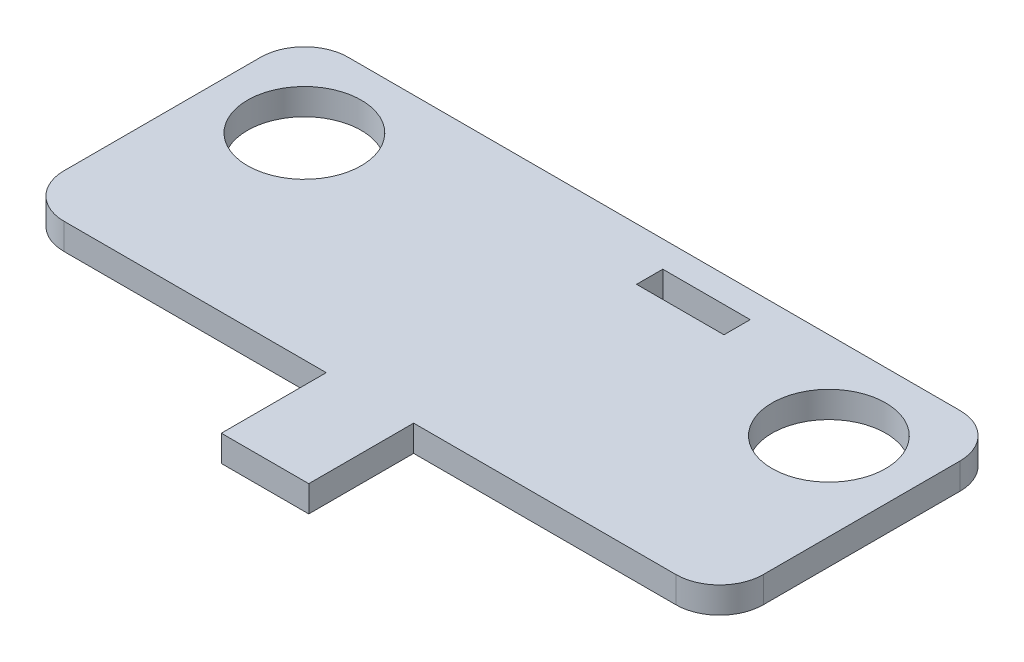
ISO-10303-21;
HEADER;
FILE_DESCRIPTION(('STEP AP214'),'2;1');
FILE_NAME('part.step','',(''),(''),'','','');
FILE_SCHEMA(('AUTOMOTIVE_DESIGN { 1 0 10303 214 1 1 1 1 }'));
ENDSEC;
DATA;
#1=APPLICATION_CONTEXT('core data for automotive mechanical design processes');
#2=APPLICATION_PROTOCOL_DEFINITION('international standard','automotive_design',2000,#1);
#3=PRODUCT_CONTEXT('',#1,'mechanical');
#4=PRODUCT('Part','Part','',(#3));
#5=PRODUCT_RELATED_PRODUCT_CATEGORY('part','',(#4));
#6=PRODUCT_DEFINITION_FORMATION('','',#4);
#7=PRODUCT_DEFINITION_CONTEXT('part definition',#1,'design');
#8=PRODUCT_DEFINITION('design','',#6,#7);
#9=PRODUCT_DEFINITION_SHAPE('','',#8);
#10=(LENGTH_UNIT() NAMED_UNIT(*) SI_UNIT(.MILLI.,.METRE.));
#11=(NAMED_UNIT(*) PLANE_ANGLE_UNIT() SI_UNIT($,.RADIAN.));
#12=(NAMED_UNIT(*) SI_UNIT($,.STERADIAN.) SOLID_ANGLE_UNIT());
#13=UNCERTAINTY_MEASURE_WITH_UNIT(LENGTH_MEASURE(1.E-05),#10,'distance_accuracy_value','');
#14=(GEOMETRIC_REPRESENTATION_CONTEXT(3) GLOBAL_UNCERTAINTY_ASSIGNED_CONTEXT((#13)) GLOBAL_UNIT_ASSIGNED_CONTEXT((#10,
#11,#12)) REPRESENTATION_CONTEXT('',''));
#15=CARTESIAN_POINT('',(0.,0.,0.));
#16=DIRECTION('',(0.,0.,1.));
#17=DIRECTION('',(1.,0.,0.));
#18=AXIS2_PLACEMENT_3D('',#15,#16,#17);
#19=CARTESIAN_POINT('',(-40.,3.,16.25));
#20=DIRECTION('',(0.,0.,-1.));
#21=DIRECTION('',(-1.,0.,0.));
#22=AXIS2_PLACEMENT_3D('',#19,#20,#21);
#23=PLANE('',#22);
#24=DIRECTION('',(1.,0.,0.));
#25=VECTOR('',#24,1.);
#26=CARTESIAN_POINT('',(-40.,3.,16.25));
#27=LINE('',#26,#25);
#28=CARTESIAN_POINT('',(5.,3.,16.25));
#29=VERTEX_POINT('',#28);
#30=CARTESIAN_POINT('',(35.,3.,16.25));
#31=VERTEX_POINT('',#30);
#32=EDGE_CURVE('E232',#29,#31,#27,.T.);
#33=ORIENTED_EDGE('',*,*,#32,.F.);
#34=DIRECTION('',(0.,1.,0.));
#35=VECTOR('',#34,1.);
#36=CARTESIAN_POINT('',(5.,0.,16.25));
#37=LINE('',#36,#35);
#38=CARTESIAN_POINT('',(5.,0.,16.25));
#39=VERTEX_POINT('',#38);
#40=EDGE_CURVE('E193',#39,#29,#37,.T.);
#41=ORIENTED_EDGE('',*,*,#40,.F.);
#42=DIRECTION('',(1.,0.,0.));
#43=VECTOR('',#42,1.);
#44=CARTESIAN_POINT('',(-40.,0.,16.25));
#45=LINE('',#44,#43);
#46=CARTESIAN_POINT('',(35.,0.,16.25));
#47=VERTEX_POINT('',#46);
#48=EDGE_CURVE('E245',#39,#47,#45,.T.);
#49=ORIENTED_EDGE('',*,*,#48,.T.);
#50=DIRECTION('',(0.,-1.,0.));
#51=VECTOR('',#50,1.);
#52=CARTESIAN_POINT('',(35.,3.,16.25));
#53=LINE('',#52,#51);
#54=EDGE_CURVE('E11',#47,#31,#53,.F.);
#55=ORIENTED_EDGE('',*,*,#54,.T.);
#56=EDGE_LOOP('',(#33,#41,#49,#55));
#57=FACE_BOUND('',#56,.T.);
#58=ADVANCED_FACE('F33',(#57),#23,.F.);
#59=CARTESIAN_POINT('',(40.,3.,-16.25));
#60=DIRECTION('',(-1.,0.,0.));
#61=DIRECTION('',(0.,0.,1.));
#62=AXIS2_PLACEMENT_3D('',#59,#60,#61);
#63=PLANE('',#62);
#64=DIRECTION('',(0.,0.,-1.));
#65=VECTOR('',#64,1.);
#66=CARTESIAN_POINT('',(40.,0.,-16.25));
#67=LINE('',#66,#65);
#68=CARTESIAN_POINT('',(40.,0.,11.25));
#69=VERTEX_POINT('',#68);
#70=CARTESIAN_POINT('',(40.,0.,-11.25));
#71=VERTEX_POINT('',#70);
#72=EDGE_CURVE('E219',#69,#71,#67,.T.);
#73=ORIENTED_EDGE('',*,*,#72,.T.);
#74=DIRECTION('',(0.,-1.,0.));
#75=VECTOR('',#74,1.);
#76=CARTESIAN_POINT('',(40.,3.,-11.25));
#77=LINE('',#76,#75);
#78=CARTESIAN_POINT('',(40.,3.,-11.25));
#79=VERTEX_POINT('',#78);
#80=EDGE_CURVE('E276',#71,#79,#77,.F.);
#81=ORIENTED_EDGE('',*,*,#80,.T.);
#82=DIRECTION('',(0.,0.,-1.));
#83=VECTOR('',#82,1.);
#84=CARTESIAN_POINT('',(40.,3.,-16.25));
#85=LINE('',#84,#83);
#86=CARTESIAN_POINT('',(40.,3.,11.25));
#87=VERTEX_POINT('',#86);
#88=EDGE_CURVE('E222',#87,#79,#85,.T.);
#89=ORIENTED_EDGE('',*,*,#88,.F.);
#90=DIRECTION('',(0.,-1.,0.));
#91=VECTOR('',#90,1.);
#92=CARTESIAN_POINT('',(40.,3.,11.25));
#93=LINE('',#92,#91);
#94=EDGE_CURVE('E273',#87,#69,#93,.T.);
#95=ORIENTED_EDGE('',*,*,#94,.T.);
#96=EDGE_LOOP('',(#73,#81,#89,#95));
#97=FACE_BOUND('',#96,.T.);
#98=ADVANCED_FACE('F317',(#97),#63,.F.);
#99=CARTESIAN_POINT('',(-40.,3.,-16.25));
#100=DIRECTION('',(0.,0.,1.));
#101=DIRECTION('',(1.,0.,0.));
#102=AXIS2_PLACEMENT_3D('',#99,#100,#101);
#103=PLANE('',#102);
#104=DIRECTION('',(-1.,0.,0.));
#105=VECTOR('',#104,1.);
#106=CARTESIAN_POINT('',(-40.,0.,-16.25));
#107=LINE('',#106,#105);
#108=CARTESIAN_POINT('',(35.,0.,-16.25));
#109=VERTEX_POINT('',#108);
#110=CARTESIAN_POINT('',(-35.,0.,-16.25));
#111=VERTEX_POINT('',#110);
#112=EDGE_CURVE('E239',#109,#111,#107,.T.);
#113=ORIENTED_EDGE('',*,*,#112,.T.);
#114=DIRECTION('',(0.,-1.,0.));
#115=VECTOR('',#114,1.);
#116=CARTESIAN_POINT('',(-35.,3.,-16.25));
#117=LINE('',#116,#115);
#118=CARTESIAN_POINT('',(-35.,3.,-16.25));
#119=VERTEX_POINT('',#118);
#120=EDGE_CURVE('E263',#111,#119,#117,.F.);
#121=ORIENTED_EDGE('',*,*,#120,.T.);
#122=DIRECTION('',(-1.,0.,0.));
#123=VECTOR('',#122,1.);
#124=CARTESIAN_POINT('',(-40.,3.,-16.25));
#125=LINE('',#124,#123);
#126=CARTESIAN_POINT('',(35.,3.,-16.25));
#127=VERTEX_POINT('',#126);
#128=EDGE_CURVE('E225',#127,#119,#125,.T.);
#129=ORIENTED_EDGE('',*,*,#128,.F.);
#130=DIRECTION('',(0.,-1.,0.));
#131=VECTOR('',#130,1.);
#132=CARTESIAN_POINT('',(35.,3.,-16.25));
#133=LINE('',#132,#131);
#134=EDGE_CURVE('E260',#127,#109,#133,.T.);
#135=ORIENTED_EDGE('',*,*,#134,.T.);
#136=EDGE_LOOP('',(#113,#121,#129,#135));
#137=FACE_BOUND('',#136,.T.);
#138=ADVANCED_FACE('F306',(#137),#103,.F.);
#139=CARTESIAN_POINT('',(-40.,3.,-16.25));
#140=DIRECTION('',(1.,0.,0.));
#141=DIRECTION('',(0.,0.,-1.));
#142=AXIS2_PLACEMENT_3D('',#139,#140,#141);
#143=PLANE('',#142);
#144=DIRECTION('',(0.,0.,1.));
#145=VECTOR('',#144,1.);
#146=CARTESIAN_POINT('',(-40.,3.,-16.25));
#147=LINE('',#146,#145);
#148=CARTESIAN_POINT('',(-40.,3.,-11.25));
#149=VERTEX_POINT('',#148);
#150=CARTESIAN_POINT('',(-40.,3.,11.25));
#151=VERTEX_POINT('',#150);
#152=EDGE_CURVE('E229',#149,#151,#147,.T.);
#153=ORIENTED_EDGE('',*,*,#152,.F.);
#154=DIRECTION('',(0.,-1.,0.));
#155=VECTOR('',#154,1.);
#156=CARTESIAN_POINT('',(-40.,3.,-11.25));
#157=LINE('',#156,#155);
#158=CARTESIAN_POINT('',(-40.,0.,-11.25));
#159=VERTEX_POINT('',#158);
#160=EDGE_CURVE('E248',#149,#159,#157,.T.);
#161=ORIENTED_EDGE('',*,*,#160,.T.);
#162=DIRECTION('',(0.,0.,1.));
#163=VECTOR('',#162,1.);
#164=CARTESIAN_POINT('',(-40.,0.,-16.25));
#165=LINE('',#164,#163);
#166=CARTESIAN_POINT('',(-40.,0.,11.25));
#167=VERTEX_POINT('',#166);
#168=EDGE_CURVE('E242',#159,#167,#165,.T.);
#169=ORIENTED_EDGE('',*,*,#168,.T.);
#170=DIRECTION('',(0.,-1.,0.));
#171=VECTOR('',#170,1.);
#172=CARTESIAN_POINT('',(-40.,3.,11.25));
#173=LINE('',#172,#171);
#174=EDGE_CURVE('E236',#167,#151,#173,.F.);
#175=ORIENTED_EDGE('',*,*,#174,.T.);
#176=EDGE_LOOP('',(#153,#161,#169,#175));
#177=FACE_BOUND('',#176,.T.);
#178=ADVANCED_FACE('F300',(#177),#143,.F.);
#179=CARTESIAN_POINT('',(-35.,0.,16.25));
#180=VERTEX_POINT('',#179);
#181=CARTESIAN_POINT('',(-5.,0.,16.25));
#182=VERTEX_POINT('',#181);
#183=EDGE_CURVE('E226',#180,#182,#45,.T.);
#184=ORIENTED_EDGE('',*,*,#183,.T.);
#185=DIRECTION('',(0.,1.,0.));
#186=VECTOR('',#185,1.);
#187=CARTESIAN_POINT('',(-5.,0.,16.25));
#188=LINE('',#187,#186);
#189=CARTESIAN_POINT('',(-5.,3.,16.25));
#190=VERTEX_POINT('',#189);
#191=EDGE_CURVE('E206',#182,#190,#188,.T.);
#192=ORIENTED_EDGE('',*,*,#191,.T.);
#193=CARTESIAN_POINT('',(-35.,3.,16.25));
#194=VERTEX_POINT('',#193);
#195=EDGE_CURVE('E233',#194,#190,#27,.T.);
#196=ORIENTED_EDGE('',*,*,#195,.F.);
#197=DIRECTION('',(0.,-1.,0.));
#198=VECTOR('',#197,1.);
#199=CARTESIAN_POINT('',(-35.,3.,16.25));
#200=LINE('',#199,#198);
#201=EDGE_CURVE('E41',#194,#180,#200,.T.);
#202=ORIENTED_EDGE('',*,*,#201,.T.);
#203=EDGE_LOOP('',(#184,#192,#196,#202));
#204=FACE_BOUND('',#203,.T.);
#205=ADVANCED_FACE('F282',(#204),#23,.F.);
#206=CARTESIAN_POINT('',(0.,3.,0.));
#207=DIRECTION('',(0.,1.,0.));
#208=DIRECTION('',(0.,0.,1.));
#209=AXIS2_PLACEMENT_3D('',#206,#207,#208);
#210=PLANE('',#209);
#211=DIRECTION('',(0.,0.,-1.));
#212=VECTOR('',#211,1.);
#213=CARTESIAN_POINT('',(14.,3.,-13.25));
#214=LINE('',#213,#212);
#215=CARTESIAN_POINT('',(14.,3.,-10.25));
#216=VERTEX_POINT('',#215);
#217=CARTESIAN_POINT('',(14.,3.,-13.25));
#218=VERTEX_POINT('',#217);
#219=EDGE_CURVE('E48',#216,#218,#214,.T.);
#220=ORIENTED_EDGE('',*,*,#219,.F.);
#221=DIRECTION('',(1.,0.,0.));
#222=VECTOR('',#221,1.);
#223=CARTESIAN_POINT('',(4.00000000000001,3.,-10.25));
#224=LINE('',#223,#222);
#225=CARTESIAN_POINT('',(4.00000000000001,3.,-10.25));
#226=VERTEX_POINT('',#225);
#227=EDGE_CURVE('E164',#226,#216,#224,.T.);
#228=ORIENTED_EDGE('',*,*,#227,.F.);
#229=DIRECTION('',(0.,0.,1.));
#230=VECTOR('',#229,1.);
#231=CARTESIAN_POINT('',(4.00000000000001,3.,-13.25));
#232=LINE('',#231,#230);
#233=CARTESIAN_POINT('',(4.00000000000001,3.,-13.25));
#234=VERTEX_POINT('',#233);
#235=EDGE_CURVE('E167',#234,#226,#232,.T.);
#236=ORIENTED_EDGE('',*,*,#235,.F.);
#237=DIRECTION('',(-1.,0.,0.));
#238=VECTOR('',#237,1.);
#239=CARTESIAN_POINT('',(4.00000000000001,3.,-13.25));
#240=LINE('',#239,#238);
#241=EDGE_CURVE('E173',#218,#234,#240,.T.);
#242=ORIENTED_EDGE('',*,*,#241,.F.);
#243=EDGE_LOOP('',(#220,#228,#236,#242));
#244=FACE_BOUND('',#243,.T.);
#245=CARTESIAN_POINT('',(30.,3.,-6.25));
#246=DIRECTION('',(0.,1.,0.));
#247=DIRECTION('',(0.,0.,1.));
#248=AXIS2_PLACEMENT_3D('',#245,#246,#247);
#249=CIRCLE('',#248,6.50494921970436);
#250=CARTESIAN_POINT('',(30.,3.,0.254949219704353));
#251=VERTEX_POINT('',#250);
#252=EDGE_CURVE('E203',#251,#251,#249,.T.);
#253=ORIENTED_EDGE('',*,*,#252,.F.);
#254=EDGE_LOOP('',(#253));
#255=FACE_BOUND('',#254,.T.);
#256=CARTESIAN_POINT('',(-30.,3.,-6.25));
#257=DIRECTION('',(0.,1.,0.));
#258=DIRECTION('',(0.,0.,1.));
#259=AXIS2_PLACEMENT_3D('',#256,#257,#258);
#260=CIRCLE('',#259,6.50494921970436);
#261=CARTESIAN_POINT('',(-30.,3.,0.254949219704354));
#262=VERTEX_POINT('',#261);
#263=EDGE_CURVE('E213',#262,#262,#260,.T.);
#264=ORIENTED_EDGE('',*,*,#263,.F.);
#265=EDGE_LOOP('',(#264));
#266=FACE_BOUND('',#265,.T.);
#267=ORIENTED_EDGE('',*,*,#128,.T.);
#268=CARTESIAN_POINT('',(-35.,3.,-11.25));
#269=DIRECTION('',(0.,1.,0.));
#270=DIRECTION('',(0.,0.,1.));
#271=AXIS2_PLACEMENT_3D('',#268,#269,#270);
#272=CIRCLE('',#271,5.);
#273=EDGE_CURVE('E271',#119,#149,#272,.T.);
#274=ORIENTED_EDGE('',*,*,#273,.T.);
#275=ORIENTED_EDGE('',*,*,#152,.T.);
#276=CARTESIAN_POINT('',(-35.,3.,11.25));
#277=DIRECTION('',(0.,1.,0.));
#278=DIRECTION('',(0.,0.,1.));
#279=AXIS2_PLACEMENT_3D('',#276,#277,#278);
#280=CIRCLE('',#279,5.);
#281=EDGE_CURVE('E265',#151,#194,#280,.T.);
#282=ORIENTED_EDGE('',*,*,#281,.T.);
#283=ORIENTED_EDGE('',*,*,#195,.T.);
#284=DIRECTION('',(0.,0.,1.));
#285=VECTOR('',#284,1.);
#286=CARTESIAN_POINT('',(-5.,3.,16.25));
#287=LINE('',#286,#285);
#288=CARTESIAN_POINT('',(-5.,3.,28.25));
#289=VERTEX_POINT('',#288);
#290=EDGE_CURVE('E196',#190,#289,#287,.T.);
#291=ORIENTED_EDGE('',*,*,#290,.T.);
#292=DIRECTION('',(1.,0.,0.));
#293=VECTOR('',#292,1.);
#294=CARTESIAN_POINT('',(-5.,3.,28.25));
#295=LINE('',#294,#293);
#296=CARTESIAN_POINT('',(5.,3.,28.25));
#297=VERTEX_POINT('',#296);
#298=EDGE_CURVE('E187',#289,#297,#295,.T.);
#299=ORIENTED_EDGE('',*,*,#298,.T.);
#300=DIRECTION('',(0.,0.,-1.));
#301=VECTOR('',#300,1.);
#302=CARTESIAN_POINT('',(5.,3.,16.25));
#303=LINE('',#302,#301);
#304=EDGE_CURVE('E179',#297,#29,#303,.T.);
#305=ORIENTED_EDGE('',*,*,#304,.T.);
#306=ORIENTED_EDGE('',*,*,#32,.T.);
#307=CARTESIAN_POINT('',(35.,3.,11.25));
#308=DIRECTION('',(0.,1.,0.));
#309=DIRECTION('',(0.,0.,1.));
#310=AXIS2_PLACEMENT_3D('',#307,#308,#309);
#311=CIRCLE('',#310,5.);
#312=EDGE_CURVE('E267',#31,#87,#311,.T.);
#313=ORIENTED_EDGE('',*,*,#312,.T.);
#314=ORIENTED_EDGE('',*,*,#88,.T.);
#315=CARTESIAN_POINT('',(35.,3.,-11.25));
#316=DIRECTION('',(0.,1.,0.));
#317=DIRECTION('',(0.,0.,1.));
#318=AXIS2_PLACEMENT_3D('',#315,#316,#317);
#319=CIRCLE('',#318,5.);
#320=EDGE_CURVE('E269',#79,#127,#319,.T.);
#321=ORIENTED_EDGE('',*,*,#320,.T.);
#322=EDGE_LOOP('',(#267,#274,#275,#282,#283,#291,#299,#305,#306,#313,#314,#321));
#323=FACE_BOUND('',#322,.T.);
#324=ADVANCED_FACE('F295',(#244,#255,#266,#323),#210,.T.);
#325=CARTESIAN_POINT('',(0.,0.,0.));
#326=DIRECTION('',(0.,1.,0.));
#327=DIRECTION('',(0.,0.,1.));
#328=AXIS2_PLACEMENT_3D('',#325,#326,#327);
#329=PLANE('',#328);
#330=DIRECTION('',(1.,0.,0.));
#331=VECTOR('',#330,1.);
#332=CARTESIAN_POINT('',(4.00000000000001,0.,-10.25));
#333=LINE('',#332,#331);
#334=CARTESIAN_POINT('',(4.00000000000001,0.,-10.25));
#335=VERTEX_POINT('',#334);
#336=CARTESIAN_POINT('',(14.,0.,-10.25));
#337=VERTEX_POINT('',#336);
#338=EDGE_CURVE('E154',#335,#337,#333,.T.);
#339=ORIENTED_EDGE('',*,*,#338,.T.);
#340=DIRECTION('',(0.,0.,-1.));
#341=VECTOR('',#340,1.);
#342=CARTESIAN_POINT('',(14.,0.,-13.25));
#343=LINE('',#342,#341);
#344=CARTESIAN_POINT('',(14.,0.,-13.25));
#345=VERTEX_POINT('',#344);
#346=EDGE_CURVE('E148',#337,#345,#343,.T.);
#347=ORIENTED_EDGE('',*,*,#346,.T.);
#348=DIRECTION('',(-1.,0.,0.));
#349=VECTOR('',#348,1.);
#350=CARTESIAN_POINT('',(4.00000000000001,0.,-13.25));
#351=LINE('',#350,#349);
#352=CARTESIAN_POINT('',(4.00000000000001,0.,-13.25));
#353=VERTEX_POINT('',#352);
#354=EDGE_CURVE('E157',#345,#353,#351,.T.);
#355=ORIENTED_EDGE('',*,*,#354,.T.);
#356=DIRECTION('',(0.,0.,1.));
#357=VECTOR('',#356,1.);
#358=CARTESIAN_POINT('',(4.00000000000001,0.,-13.25));
#359=LINE('',#358,#357);
#360=EDGE_CURVE('E56',#353,#335,#359,.T.);
#361=ORIENTED_EDGE('',*,*,#360,.T.);
#362=EDGE_LOOP('',(#339,#347,#355,#361));
#363=FACE_BOUND('',#362,.T.);
#364=CARTESIAN_POINT('',(30.,0.,-6.25));
#365=DIRECTION('',(0.,1.,0.));
#366=DIRECTION('',(0.,0.,1.));
#367=AXIS2_PLACEMENT_3D('',#364,#365,#366);
#368=CIRCLE('',#367,6.50494921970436);
#369=CARTESIAN_POINT('',(30.,0.,0.254949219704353));
#370=VERTEX_POINT('',#369);
#371=EDGE_CURVE('E210',#370,#370,#368,.T.);
#372=ORIENTED_EDGE('',*,*,#371,.T.);
#373=EDGE_LOOP('',(#372));
#374=FACE_BOUND('',#373,.T.);
#375=CARTESIAN_POINT('',(-30.,0.,-6.25));
#376=DIRECTION('',(0.,1.,0.));
#377=DIRECTION('',(0.,0.,1.));
#378=AXIS2_PLACEMENT_3D('',#375,#376,#377);
#379=CIRCLE('',#378,6.50494921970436);
#380=CARTESIAN_POINT('',(-30.,0.,0.254949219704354));
#381=VERTEX_POINT('',#380);
#382=EDGE_CURVE('E216',#381,#381,#379,.T.);
#383=ORIENTED_EDGE('',*,*,#382,.T.);
#384=EDGE_LOOP('',(#383));
#385=FACE_BOUND('',#384,.T.);
#386=ORIENTED_EDGE('',*,*,#168,.F.);
#387=CARTESIAN_POINT('',(-35.,0.,-11.25));
#388=DIRECTION('',(0.,1.,0.));
#389=DIRECTION('',(0.,0.,1.));
#390=AXIS2_PLACEMENT_3D('',#387,#388,#389);
#391=CIRCLE('',#390,5.);
#392=EDGE_CURVE('E258',#159,#111,#391,.F.);
#393=ORIENTED_EDGE('',*,*,#392,.T.);
#394=ORIENTED_EDGE('',*,*,#112,.F.);
#395=CARTESIAN_POINT('',(35.,0.,-11.25));
#396=DIRECTION('',(0.,1.,0.));
#397=DIRECTION('',(0.,0.,1.));
#398=AXIS2_PLACEMENT_3D('',#395,#396,#397);
#399=CIRCLE('',#398,5.);
#400=EDGE_CURVE('E256',#109,#71,#399,.F.);
#401=ORIENTED_EDGE('',*,*,#400,.T.);
#402=ORIENTED_EDGE('',*,*,#72,.F.);
#403=CARTESIAN_POINT('',(35.,0.,11.25));
#404=DIRECTION('',(0.,1.,0.));
#405=DIRECTION('',(0.,0.,1.));
#406=AXIS2_PLACEMENT_3D('',#403,#404,#405);
#407=CIRCLE('',#406,5.);
#408=EDGE_CURVE('E253',#69,#47,#407,.F.);
#409=ORIENTED_EDGE('',*,*,#408,.T.);
#410=ORIENTED_EDGE('',*,*,#48,.F.);
#411=DIRECTION('',(0.,0.,-1.));
#412=VECTOR('',#411,1.);
#413=CARTESIAN_POINT('',(5.,0.,16.25));
#414=LINE('',#413,#412);
#415=CARTESIAN_POINT('',(5.,0.,28.25));
#416=VERTEX_POINT('',#415);
#417=EDGE_CURVE('E183',#416,#39,#414,.T.);
#418=ORIENTED_EDGE('',*,*,#417,.F.);
#419=DIRECTION('',(1.,0.,0.));
#420=VECTOR('',#419,1.);
#421=CARTESIAN_POINT('',(-5.,0.,28.25));
#422=LINE('',#421,#420);
#423=CARTESIAN_POINT('',(-5.,0.,28.25));
#424=VERTEX_POINT('',#423);
#425=EDGE_CURVE('E190',#424,#416,#422,.T.);
#426=ORIENTED_EDGE('',*,*,#425,.F.);
#427=DIRECTION('',(0.,0.,1.));
#428=VECTOR('',#427,1.);
#429=CARTESIAN_POINT('',(-5.,0.,16.25));
#430=LINE('',#429,#428);
#431=EDGE_CURVE('E186',#182,#424,#430,.T.);
#432=ORIENTED_EDGE('',*,*,#431,.F.);
#433=ORIENTED_EDGE('',*,*,#183,.F.);
#434=CARTESIAN_POINT('',(-35.,0.,11.25));
#435=DIRECTION('',(0.,1.,0.));
#436=DIRECTION('',(0.,0.,1.));
#437=AXIS2_PLACEMENT_3D('',#434,#435,#436);
#438=CIRCLE('',#437,5.);
#439=EDGE_CURVE('E251',#180,#167,#438,.F.);
#440=ORIENTED_EDGE('',*,*,#439,.T.);
#441=EDGE_LOOP('',(#386,#393,#394,#401,#402,#409,#410,#418,#426,#432,#433,#440));
#442=FACE_BOUND('',#441,.T.);
#443=ADVANCED_FACE('F161',(#363,#374,#385,#442),#329,.F.);
#444=CARTESIAN_POINT('',(-35.,3.,-11.25));
#445=DIRECTION('',(0.,-1.,0.));
#446=DIRECTION('',(0.,0.,-1.));
#447=AXIS2_PLACEMENT_3D('',#444,#445,#446);
#448=CYLINDRICAL_SURFACE('',#447,5.);
#449=ORIENTED_EDGE('',*,*,#273,.F.);
#450=ORIENTED_EDGE('',*,*,#120,.F.);
#451=ORIENTED_EDGE('',*,*,#392,.F.);
#452=ORIENTED_EDGE('',*,*,#160,.F.);
#453=EDGE_LOOP('',(#449,#450,#451,#452));
#454=FACE_BOUND('',#453,.T.);
#455=ADVANCED_FACE('F310',(#454),#448,.T.);
#456=CARTESIAN_POINT('',(35.,3.,-11.25));
#457=DIRECTION('',(0.,-1.,0.));
#458=DIRECTION('',(0.,0.,-1.));
#459=AXIS2_PLACEMENT_3D('',#456,#457,#458);
#460=CYLINDRICAL_SURFACE('',#459,5.);
#461=ORIENTED_EDGE('',*,*,#320,.F.);
#462=ORIENTED_EDGE('',*,*,#80,.F.);
#463=ORIENTED_EDGE('',*,*,#400,.F.);
#464=ORIENTED_EDGE('',*,*,#134,.F.);
#465=EDGE_LOOP('',(#461,#462,#463,#464));
#466=FACE_BOUND('',#465,.T.);
#467=ADVANCED_FACE('F313',(#466),#460,.T.);
#468=CARTESIAN_POINT('',(35.,3.,11.25));
#469=DIRECTION('',(0.,-1.,0.));
#470=DIRECTION('',(0.,0.,-1.));
#471=AXIS2_PLACEMENT_3D('',#468,#469,#470);
#472=CYLINDRICAL_SURFACE('',#471,5.);
#473=ORIENTED_EDGE('',*,*,#312,.F.);
#474=ORIENTED_EDGE('',*,*,#54,.F.);
#475=ORIENTED_EDGE('',*,*,#408,.F.);
#476=ORIENTED_EDGE('',*,*,#94,.F.);
#477=EDGE_LOOP('',(#473,#474,#475,#476));
#478=FACE_BOUND('',#477,.T.);
#479=ADVANCED_FACE('F322',(#478),#472,.T.);
#480=CARTESIAN_POINT('',(-35.,3.,11.25));
#481=DIRECTION('',(0.,-1.,0.));
#482=DIRECTION('',(0.,0.,-1.));
#483=AXIS2_PLACEMENT_3D('',#480,#481,#482);
#484=CYLINDRICAL_SURFACE('',#483,5.);
#485=ORIENTED_EDGE('',*,*,#281,.F.);
#486=ORIENTED_EDGE('',*,*,#174,.F.);
#487=ORIENTED_EDGE('',*,*,#439,.F.);
#488=ORIENTED_EDGE('',*,*,#201,.F.);
#489=EDGE_LOOP('',(#485,#486,#487,#488));
#490=FACE_BOUND('',#489,.T.);
#491=ADVANCED_FACE('F35',(#490),#484,.T.);
#492=CARTESIAN_POINT('',(-30.,0.,-6.25));
#493=DIRECTION('',(0.,1.,0.));
#494=DIRECTION('',(0.,0.,1.));
#495=AXIS2_PLACEMENT_3D('',#492,#493,#494);
#496=CYLINDRICAL_SURFACE('',#495,6.50494921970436);
#497=ORIENTED_EDGE('',*,*,#382,.F.);
#498=EDGE_LOOP('',(#497));
#499=FACE_BOUND('',#498,.T.);
#500=ORIENTED_EDGE('',*,*,#263,.T.);
#501=EDGE_LOOP('',(#500));
#502=FACE_BOUND('',#501,.T.);
#503=ADVANCED_FACE('F368',(#499,#502),#496,.F.);
#504=CARTESIAN_POINT('',(30.,0.,-6.25));
#505=DIRECTION('',(0.,1.,0.));
#506=DIRECTION('',(0.,0.,1.));
#507=AXIS2_PLACEMENT_3D('',#504,#505,#506);
#508=CYLINDRICAL_SURFACE('',#507,6.50494921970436);
#509=ORIENTED_EDGE('',*,*,#371,.F.);
#510=EDGE_LOOP('',(#509));
#511=FACE_BOUND('',#510,.T.);
#512=ORIENTED_EDGE('',*,*,#252,.T.);
#513=EDGE_LOOP('',(#512));
#514=FACE_BOUND('',#513,.T.);
#515=ADVANCED_FACE('F338',(#511,#514),#508,.F.);
#516=CARTESIAN_POINT('',(5.,0.,16.25));
#517=DIRECTION('',(1.,0.,0.));
#518=DIRECTION('',(0.,0.,-1.));
#519=AXIS2_PLACEMENT_3D('',#516,#517,#518);
#520=PLANE('',#519);
#521=ORIENTED_EDGE('',*,*,#304,.F.);
#522=DIRECTION('',(0.,1.,0.));
#523=VECTOR('',#522,1.);
#524=CARTESIAN_POINT('',(5.,0.,28.25));
#525=LINE('',#524,#523);
#526=EDGE_CURVE('E201',#416,#297,#525,.T.);
#527=ORIENTED_EDGE('',*,*,#526,.F.);
#528=ORIENTED_EDGE('',*,*,#417,.T.);
#529=ORIENTED_EDGE('',*,*,#40,.T.);
#530=EDGE_LOOP('',(#521,#527,#528,#529));
#531=FACE_BOUND('',#530,.T.);
#532=ADVANCED_FACE('F328',(#531),#520,.T.);
#533=CARTESIAN_POINT('',(-5.,0.,28.25));
#534=DIRECTION('',(0.,0.,1.));
#535=DIRECTION('',(1.,0.,0.));
#536=AXIS2_PLACEMENT_3D('',#533,#534,#535);
#537=PLANE('',#536);
#538=ORIENTED_EDGE('',*,*,#298,.F.);
#539=DIRECTION('',(0.,1.,0.));
#540=VECTOR('',#539,1.);
#541=CARTESIAN_POINT('',(-5.,0.,28.25));
#542=LINE('',#541,#540);
#543=EDGE_CURVE('E204',#424,#289,#542,.T.);
#544=ORIENTED_EDGE('',*,*,#543,.F.);
#545=ORIENTED_EDGE('',*,*,#425,.T.);
#546=ORIENTED_EDGE('',*,*,#526,.T.);
#547=EDGE_LOOP('',(#538,#544,#545,#546));
#548=FACE_BOUND('',#547,.T.);
#549=ADVANCED_FACE('F330',(#548),#537,.T.);
#550=CARTESIAN_POINT('',(-5.,0.,16.25));
#551=DIRECTION('',(-1.,0.,0.));
#552=DIRECTION('',(0.,0.,1.));
#553=AXIS2_PLACEMENT_3D('',#550,#551,#552);
#554=PLANE('',#553);
#555=ORIENTED_EDGE('',*,*,#290,.F.);
#556=ORIENTED_EDGE('',*,*,#191,.F.);
#557=ORIENTED_EDGE('',*,*,#431,.T.);
#558=ORIENTED_EDGE('',*,*,#543,.T.);
#559=EDGE_LOOP('',(#555,#556,#557,#558));
#560=FACE_BOUND('',#559,.T.);
#561=ADVANCED_FACE('F293',(#560),#554,.T.);
#562=CARTESIAN_POINT('',(14.,0.,-13.25));
#563=DIRECTION('',(1.,0.,0.));
#564=DIRECTION('',(0.,0.,-1.));
#565=AXIS2_PLACEMENT_3D('',#562,#563,#564);
#566=PLANE('',#565);
#567=ORIENTED_EDGE('',*,*,#219,.T.);
#568=DIRECTION('',(0.,1.,0.));
#569=VECTOR('',#568,1.);
#570=CARTESIAN_POINT('',(14.,0.,-13.25));
#571=LINE('',#570,#569);
#572=EDGE_CURVE('E144',#345,#218,#571,.T.);
#573=ORIENTED_EDGE('',*,*,#572,.F.);
#574=ORIENTED_EDGE('',*,*,#346,.F.);
#575=DIRECTION('',(0.,1.,0.));
#576=VECTOR('',#575,1.);
#577=CARTESIAN_POINT('',(14.,0.,-10.25));
#578=LINE('',#577,#576);
#579=EDGE_CURVE('E177',#337,#216,#578,.T.);
#580=ORIENTED_EDGE('',*,*,#579,.T.);
#581=EDGE_LOOP('',(#567,#573,#574,#580));
#582=FACE_BOUND('',#581,.T.);
#583=ADVANCED_FACE('F146',(#582),#566,.F.);
#584=CARTESIAN_POINT('',(4.00000000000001,0.,-10.25));
#585=DIRECTION('',(0.,0.,1.));
#586=DIRECTION('',(1.,0.,0.));
#587=AXIS2_PLACEMENT_3D('',#584,#585,#586);
#588=PLANE('',#587);
#589=ORIENTED_EDGE('',*,*,#227,.T.);
#590=ORIENTED_EDGE('',*,*,#579,.F.);
#591=ORIENTED_EDGE('',*,*,#338,.F.);
#592=DIRECTION('',(0.,1.,0.));
#593=VECTOR('',#592,1.);
#594=CARTESIAN_POINT('',(4.00000000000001,0.,-10.25));
#595=LINE('',#594,#593);
#596=EDGE_CURVE('E180',#335,#226,#595,.T.);
#597=ORIENTED_EDGE('',*,*,#596,.T.);
#598=EDGE_LOOP('',(#589,#590,#591,#597));
#599=FACE_BOUND('',#598,.T.);
#600=ADVANCED_FACE('F460',(#599),#588,.F.);
#601=CARTESIAN_POINT('',(4.00000000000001,0.,-13.25));
#602=DIRECTION('',(-1.,0.,0.));
#603=DIRECTION('',(0.,0.,1.));
#604=AXIS2_PLACEMENT_3D('',#601,#602,#603);
#605=PLANE('',#604);
#606=ORIENTED_EDGE('',*,*,#235,.T.);
#607=ORIENTED_EDGE('',*,*,#596,.F.);
#608=ORIENTED_EDGE('',*,*,#360,.F.);
#609=DIRECTION('',(0.,1.,0.));
#610=VECTOR('',#609,1.);
#611=CARTESIAN_POINT('',(4.00000000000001,0.,-13.25));
#612=LINE('',#611,#610);
#613=EDGE_CURVE('E153',#353,#234,#612,.T.);
#614=ORIENTED_EDGE('',*,*,#613,.T.);
#615=EDGE_LOOP('',(#606,#607,#608,#614));
#616=FACE_BOUND('',#615,.T.);
#617=ADVANCED_FACE('F465',(#616),#605,.F.);
#618=CARTESIAN_POINT('',(4.00000000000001,0.,-13.25));
#619=DIRECTION('',(0.,0.,-1.));
#620=DIRECTION('',(-1.,0.,0.));
#621=AXIS2_PLACEMENT_3D('',#618,#619,#620);
#622=PLANE('',#621);
#623=ORIENTED_EDGE('',*,*,#241,.T.);
#624=ORIENTED_EDGE('',*,*,#613,.F.);
#625=ORIENTED_EDGE('',*,*,#354,.F.);
#626=ORIENTED_EDGE('',*,*,#572,.T.);
#627=EDGE_LOOP('',(#623,#624,#625,#626));
#628=FACE_BOUND('',#627,.T.);
#629=ADVANCED_FACE('F158',(#628),#622,.F.);
#630=CLOSED_SHELL('',(#58,#98,#138,#178,#205,#324,#443,#455,#467,#479,#491,#503,#515,#532,#549,
#561,#583,#600,#617,#629));
#631=MANIFOLD_SOLID_BREP('B2',#630);
#632=ADVANCED_BREP_SHAPE_REPRESENTATION('',(#18,#631),#14);
#633=SHAPE_DEFINITION_REPRESENTATION(#9,#632);
ENDSEC;
END-ISO-10303-21;
